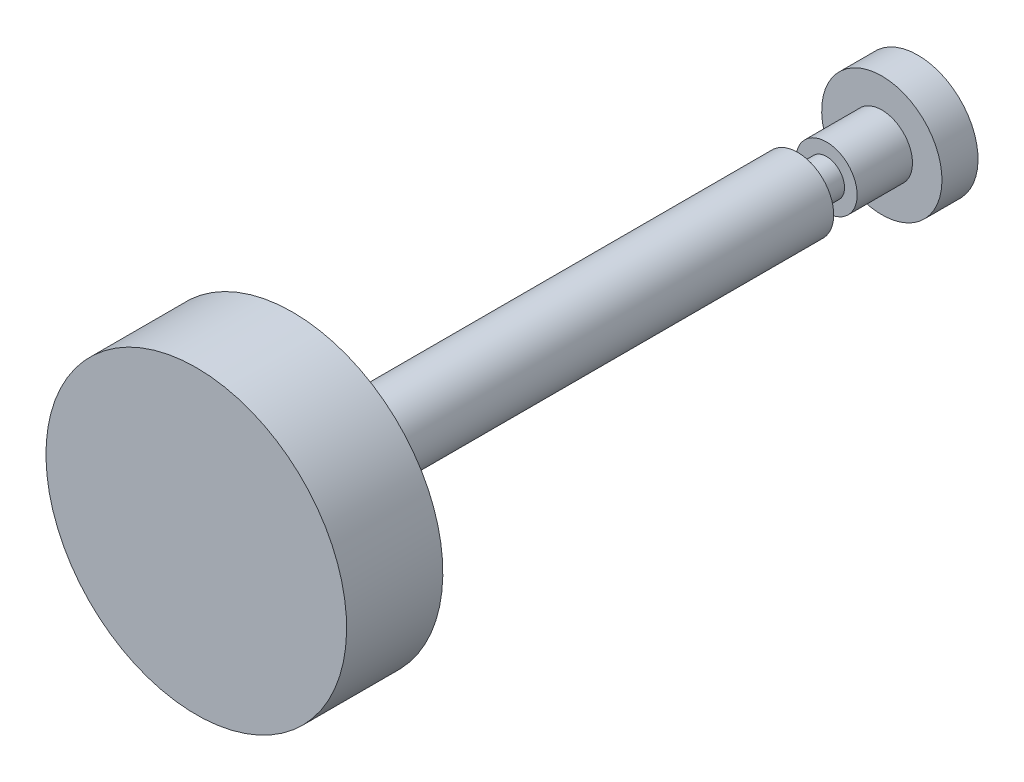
ISO-10303-21;
HEADER;
FILE_DESCRIPTION(('STEP AP214'),'2;1');
FILE_NAME('part.step','',(''),(''),'','','');
FILE_SCHEMA(('AUTOMOTIVE_DESIGN { 1 0 10303 214 1 1 1 1 }'));
ENDSEC;
DATA;
#1=APPLICATION_CONTEXT('core data for automotive mechanical design processes');
#2=APPLICATION_PROTOCOL_DEFINITION('international standard','automotive_design',2000,#1);
#3=PRODUCT_CONTEXT('',#1,'mechanical');
#4=PRODUCT('Part','Part','',(#3));
#5=PRODUCT_RELATED_PRODUCT_CATEGORY('part','',(#4));
#6=PRODUCT_DEFINITION_FORMATION('','',#4);
#7=PRODUCT_DEFINITION_CONTEXT('part definition',#1,'design');
#8=PRODUCT_DEFINITION('design','',#6,#7);
#9=PRODUCT_DEFINITION_SHAPE('','',#8);
#10=(LENGTH_UNIT() NAMED_UNIT(*) SI_UNIT(.MILLI.,.METRE.));
#11=(NAMED_UNIT(*) PLANE_ANGLE_UNIT() SI_UNIT($,.RADIAN.));
#12=(NAMED_UNIT(*) SI_UNIT($,.STERADIAN.) SOLID_ANGLE_UNIT());
#13=UNCERTAINTY_MEASURE_WITH_UNIT(LENGTH_MEASURE(1.E-05),#10,'distance_accuracy_value','');
#14=(GEOMETRIC_REPRESENTATION_CONTEXT(3) GLOBAL_UNCERTAINTY_ASSIGNED_CONTEXT((#13)) GLOBAL_UNIT_ASSIGNED_CONTEXT((#10,
#11,#12)) REPRESENTATION_CONTEXT('',''));
#15=CARTESIAN_POINT('',(0.,0.,0.));
#16=DIRECTION('',(0.,0.,1.));
#17=DIRECTION('',(1.,0.,0.));
#18=AXIS2_PLACEMENT_3D('',#15,#16,#17);
#19=CARTESIAN_POINT('',(0.,0.,0.));
#20=DIRECTION('',(0.,0.,1.));
#21=DIRECTION('',(0.,1.,0.));
#22=AXIS2_PLACEMENT_3D('',#19,#20,#21);
#23=PLANE('',#22);
#24=CARTESIAN_POINT('',(0.,0.,0.));
#25=DIRECTION('',(0.,0.,1.));
#26=DIRECTION('',(0.,1.,0.));
#27=AXIS2_PLACEMENT_3D('',#24,#25,#26);
#28=CIRCLE('',#27,5.);
#29=CARTESIAN_POINT('',(0.,5.,0.));
#30=VERTEX_POINT('',#29);
#31=EDGE_CURVE('E8',#30,#30,#28,.T.);
#32=ORIENTED_EDGE('',*,*,#31,.F.);
#33=EDGE_LOOP('',(#32));
#34=FACE_BOUND('',#33,.T.);
#35=ADVANCED_FACE('F12',(#34),#23,.F.);
#36=CARTESIAN_POINT('',(0.,0.,50.));
#37=DIRECTION('',(0.,0.,1.));
#38=DIRECTION('',(0.,1.,0.));
#39=AXIS2_PLACEMENT_3D('',#36,#37,#38);
#40=CYLINDRICAL_SURFACE('',#39,5.);
#41=CARTESIAN_POINT('',(0.,0.,3.));
#42=DIRECTION('',(0.,0.,1.));
#43=DIRECTION('',(0.,1.,0.));
#44=AXIS2_PLACEMENT_3D('',#41,#42,#43);
#45=CIRCLE('',#44,5.);
#46=CARTESIAN_POINT('',(0.,5.,3.));
#47=VERTEX_POINT('',#46);
#48=EDGE_CURVE('E18',#47,#47,#45,.T.);
#49=ORIENTED_EDGE('',*,*,#48,.F.);
#50=EDGE_LOOP('',(#49));
#51=FACE_BOUND('',#50,.T.);
#52=ORIENTED_EDGE('',*,*,#31,.T.);
#53=EDGE_LOOP('',(#52));
#54=FACE_BOUND('',#53,.T.);
#55=ADVANCED_FACE('F71',(#51,#54),#40,.T.);
#56=CARTESIAN_POINT('',(0.,-5.,3.));
#57=DIRECTION('',(0.,0.,-1.));
#58=DIRECTION('',(0.,-1.,0.));
#59=AXIS2_PLACEMENT_3D('',#56,#57,#58);
#60=PLANE('',#59);
#61=CARTESIAN_POINT('',(0.,0.,3.));
#62=DIRECTION('',(0.,0.,1.));
#63=DIRECTION('',(0.,1.,0.));
#64=AXIS2_PLACEMENT_3D('',#61,#62,#63);
#65=CIRCLE('',#64,2.55);
#66=CARTESIAN_POINT('',(0.,2.55,3.));
#67=VERTEX_POINT('',#66);
#68=EDGE_CURVE('E22',#67,#67,#65,.T.);
#69=ORIENTED_EDGE('',*,*,#68,.F.);
#70=EDGE_LOOP('',(#69));
#71=FACE_BOUND('',#70,.T.);
#72=ORIENTED_EDGE('',*,*,#48,.T.);
#73=EDGE_LOOP('',(#72));
#74=FACE_BOUND('',#73,.T.);
#75=ADVANCED_FACE('F76',(#71,#74),#60,.F.);
#76=CARTESIAN_POINT('',(0.,0.,50.));
#77=DIRECTION('',(0.,0.,1.));
#78=DIRECTION('',(0.,1.,0.));
#79=AXIS2_PLACEMENT_3D('',#76,#77,#78);
#80=CYLINDRICAL_SURFACE('',#79,2.55);
#81=CARTESIAN_POINT('',(0.,0.,7.6));
#82=DIRECTION('',(0.,0.,1.));
#83=DIRECTION('',(0.,1.,0.));
#84=AXIS2_PLACEMENT_3D('',#81,#82,#83);
#85=CIRCLE('',#84,2.55);
#86=CARTESIAN_POINT('',(0.,2.55,7.6));
#87=VERTEX_POINT('',#86);
#88=EDGE_CURVE('E26',#87,#87,#85,.T.);
#89=ORIENTED_EDGE('',*,*,#88,.F.);
#90=EDGE_LOOP('',(#89));
#91=FACE_BOUND('',#90,.T.);
#92=ORIENTED_EDGE('',*,*,#68,.T.);
#93=EDGE_LOOP('',(#92));
#94=FACE_BOUND('',#93,.T.);
#95=ADVANCED_FACE('F81',(#91,#94),#80,.T.);
#96=CARTESIAN_POINT('',(0.,-2.55,7.6));
#97=DIRECTION('',(0.,0.,-1.));
#98=DIRECTION('',(0.,-1.,0.));
#99=AXIS2_PLACEMENT_3D('',#96,#97,#98);
#100=PLANE('',#99);
#101=CARTESIAN_POINT('',(0.,0.,7.6));
#102=DIRECTION('',(0.,0.,1.));
#103=DIRECTION('',(0.,1.,0.));
#104=AXIS2_PLACEMENT_3D('',#101,#102,#103);
#105=CIRCLE('',#104,1.5);
#106=CARTESIAN_POINT('',(0.,1.5,7.6));
#107=VERTEX_POINT('',#106);
#108=EDGE_CURVE('E31',#107,#107,#105,.T.);
#109=ORIENTED_EDGE('',*,*,#108,.F.);
#110=EDGE_LOOP('',(#109));
#111=FACE_BOUND('',#110,.T.);
#112=ORIENTED_EDGE('',*,*,#88,.T.);
#113=EDGE_LOOP('',(#112));
#114=FACE_BOUND('',#113,.T.);
#115=ADVANCED_FACE('F87',(#111,#114),#100,.F.);
#116=CARTESIAN_POINT('',(0.,0.,50.));
#117=DIRECTION('',(0.,0.,1.));
#118=DIRECTION('',(0.,1.,0.));
#119=AXIS2_PLACEMENT_3D('',#116,#117,#118);
#120=CYLINDRICAL_SURFACE('',#119,1.5);
#121=CARTESIAN_POINT('',(0.,0.,10.));
#122=DIRECTION('',(0.,0.,1.));
#123=DIRECTION('',(0.,1.,0.));
#124=AXIS2_PLACEMENT_3D('',#121,#122,#123);
#125=CIRCLE('',#124,1.5);
#126=CARTESIAN_POINT('',(0.,1.5,10.));
#127=VERTEX_POINT('',#126);
#128=EDGE_CURVE('E34',#127,#127,#125,.T.);
#129=ORIENTED_EDGE('',*,*,#128,.F.);
#130=EDGE_LOOP('',(#129));
#131=FACE_BOUND('',#130,.T.);
#132=ORIENTED_EDGE('',*,*,#108,.T.);
#133=EDGE_LOOP('',(#132));
#134=FACE_BOUND('',#133,.T.);
#135=ADVANCED_FACE('F91',(#131,#134),#120,.T.);
#136=CARTESIAN_POINT('',(0.,-1.5,10.));
#137=DIRECTION('',(0.,0.,1.));
#138=DIRECTION('',(0.,1.,0.));
#139=AXIS2_PLACEMENT_3D('',#136,#137,#138);
#140=PLANE('',#139);
#141=CARTESIAN_POINT('',(0.,0.,10.));
#142=DIRECTION('',(0.,0.,1.));
#143=DIRECTION('',(0.,1.,0.));
#144=AXIS2_PLACEMENT_3D('',#141,#142,#143);
#145=CIRCLE('',#144,3.);
#146=CARTESIAN_POINT('',(0.,3.,10.));
#147=VERTEX_POINT('',#146);
#148=EDGE_CURVE('E37',#147,#147,#145,.T.);
#149=ORIENTED_EDGE('',*,*,#148,.F.);
#150=EDGE_LOOP('',(#149));
#151=FACE_BOUND('',#150,.T.);
#152=ORIENTED_EDGE('',*,*,#128,.T.);
#153=EDGE_LOOP('',(#152));
#154=FACE_BOUND('',#153,.T.);
#155=ADVANCED_FACE('F67',(#151,#154),#140,.F.);
#156=CARTESIAN_POINT('',(0.,0.,50.));
#157=DIRECTION('',(0.,0.,1.));
#158=DIRECTION('',(0.,1.,0.));
#159=AXIS2_PLACEMENT_3D('',#156,#157,#158);
#160=CYLINDRICAL_SURFACE('',#159,3.);
#161=CARTESIAN_POINT('',(0.,0.,52.));
#162=DIRECTION('',(0.,0.,1.));
#163=DIRECTION('',(0.,1.,0.));
#164=AXIS2_PLACEMENT_3D('',#161,#162,#163);
#165=CIRCLE('',#164,3.);
#166=CARTESIAN_POINT('',(0.,3.,52.));
#167=VERTEX_POINT('',#166);
#168=EDGE_CURVE('E40',#167,#167,#165,.T.);
#169=ORIENTED_EDGE('',*,*,#168,.F.);
#170=EDGE_LOOP('',(#169));
#171=FACE_BOUND('',#170,.T.);
#172=ORIENTED_EDGE('',*,*,#148,.T.);
#173=EDGE_LOOP('',(#172));
#174=FACE_BOUND('',#173,.T.);
#175=ADVANCED_FACE('F60',(#171,#174),#160,.T.);
#176=CARTESIAN_POINT('',(0.,-12.5,52.));
#177=DIRECTION('',(0.,0.,-1.));
#178=DIRECTION('',(0.,-1.,0.));
#179=AXIS2_PLACEMENT_3D('',#176,#177,#178);
#180=PLANE('',#179);
#181=ORIENTED_EDGE('',*,*,#168,.T.);
#182=EDGE_LOOP('',(#181));
#183=FACE_BOUND('',#182,.T.);
#184=CARTESIAN_POINT('',(0.,0.,52.));
#185=DIRECTION('',(0.,0.,1.));
#186=DIRECTION('',(0.,1.,0.));
#187=AXIS2_PLACEMENT_3D('',#184,#185,#186);
#188=CIRCLE('',#187,12.5);
#189=CARTESIAN_POINT('',(0.,12.5,52.));
#190=VERTEX_POINT('',#189);
#191=EDGE_CURVE('E43',#190,#190,#188,.T.);
#192=ORIENTED_EDGE('',*,*,#191,.F.);
#193=EDGE_LOOP('',(#192));
#194=FACE_BOUND('',#193,.T.);
#195=ADVANCED_FACE('F55',(#183,#194),#180,.T.);
#196=CARTESIAN_POINT('',(0.,0.,50.));
#197=DIRECTION('',(0.,0.,1.));
#198=DIRECTION('',(0.,1.,0.));
#199=AXIS2_PLACEMENT_3D('',#196,#197,#198);
#200=CYLINDRICAL_SURFACE('',#199,12.5);
#201=CARTESIAN_POINT('',(0.,0.,60.));
#202=DIRECTION('',(0.,0.,1.));
#203=DIRECTION('',(0.,1.,0.));
#204=AXIS2_PLACEMENT_3D('',#201,#202,#203);
#205=CIRCLE('',#204,12.5);
#206=CARTESIAN_POINT('',(0.,12.5,60.));
#207=VERTEX_POINT('',#206);
#208=EDGE_CURVE('E46',#207,#207,#205,.T.);
#209=ORIENTED_EDGE('',*,*,#208,.F.);
#210=EDGE_LOOP('',(#209));
#211=FACE_BOUND('',#210,.T.);
#212=ORIENTED_EDGE('',*,*,#191,.T.);
#213=EDGE_LOOP('',(#212));
#214=FACE_BOUND('',#213,.T.);
#215=ADVANCED_FACE('F52',(#211,#214),#200,.T.);
#216=CARTESIAN_POINT('',(0.,-12.5,60.));
#217=DIRECTION('',(0.,0.,-1.));
#218=DIRECTION('',(0.,-1.,0.));
#219=AXIS2_PLACEMENT_3D('',#216,#217,#218);
#220=PLANE('',#219);
#221=ORIENTED_EDGE('',*,*,#208,.T.);
#222=EDGE_LOOP('',(#221));
#223=FACE_BOUND('',#222,.T.);
#224=ADVANCED_FACE('F50',(#223),#220,.F.);
#225=CLOSED_SHELL('',(#35,#55,#75,#95,#115,#135,#155,#175,#195,#215,#224));
#226=MANIFOLD_SOLID_BREP('B1',#225);
#227=ADVANCED_BREP_SHAPE_REPRESENTATION('',(#18,#226),#14);
#228=SHAPE_DEFINITION_REPRESENTATION(#9,#227);
ENDSEC;
END-ISO-10303-21;
